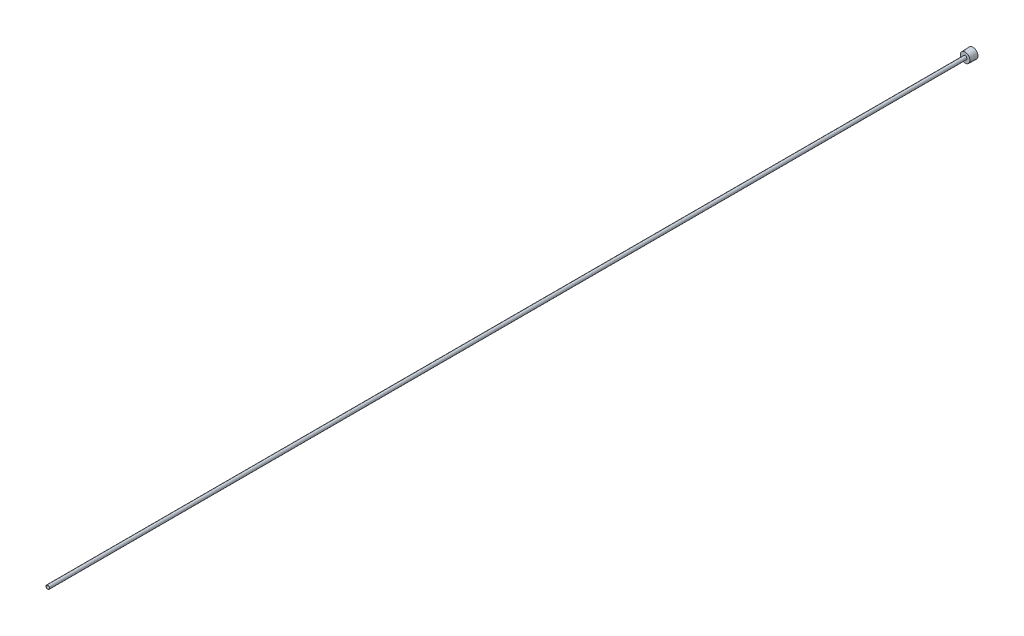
ISO-10303-21;
HEADER;
FILE_DESCRIPTION(('STEP AP214'),'2;1');
FILE_NAME('part.step','',(''),(''),'','','');
FILE_SCHEMA(('AUTOMOTIVE_DESIGN { 1 0 10303 214 1 1 1 1 }'));
ENDSEC;
DATA;
#1=APPLICATION_CONTEXT('core data for automotive mechanical design processes');
#2=APPLICATION_PROTOCOL_DEFINITION('international standard','automotive_design',2000,#1);
#3=PRODUCT_CONTEXT('',#1,'mechanical');
#4=PRODUCT('Part','Part','',(#3));
#5=PRODUCT_RELATED_PRODUCT_CATEGORY('part','',(#4));
#6=PRODUCT_DEFINITION_FORMATION('','',#4);
#7=PRODUCT_DEFINITION_CONTEXT('part definition',#1,'design');
#8=PRODUCT_DEFINITION('design','',#6,#7);
#9=PRODUCT_DEFINITION_SHAPE('','',#8);
#10=(LENGTH_UNIT() NAMED_UNIT(*) SI_UNIT(.MILLI.,.METRE.));
#11=(NAMED_UNIT(*) PLANE_ANGLE_UNIT() SI_UNIT($,.RADIAN.));
#12=(NAMED_UNIT(*) SI_UNIT($,.STERADIAN.) SOLID_ANGLE_UNIT());
#13=UNCERTAINTY_MEASURE_WITH_UNIT(LENGTH_MEASURE(1.E-05),#10,'distance_accuracy_value','');
#14=(GEOMETRIC_REPRESENTATION_CONTEXT(3) GLOBAL_UNCERTAINTY_ASSIGNED_CONTEXT((#13)) GLOBAL_UNIT_ASSIGNED_CONTEXT((#10,
#11,#12)) REPRESENTATION_CONTEXT('',''));
#15=CARTESIAN_POINT('',(0.,0.,0.));
#16=DIRECTION('',(0.,0.,1.));
#17=DIRECTION('',(1.,0.,0.));
#18=AXIS2_PLACEMENT_3D('',#15,#16,#17);
#19=CARTESIAN_POINT('',(0.,0.,0.));
#20=DIRECTION('',(0.,0.,1.));
#21=DIRECTION('',(1.,0.,0.));
#22=AXIS2_PLACEMENT_3D('',#19,#20,#21);
#23=CYLINDRICAL_SURFACE('',#22,2.1209);
#24=CARTESIAN_POINT('',(0.,0.,1219.2));
#25=DIRECTION('',(0.,0.,1.));
#26=DIRECTION('',(1.,0.,0.));
#27=AXIS2_PLACEMENT_3D('',#24,#25,#26);
#28=CIRCLE('',#27,2.1209);
#29=CARTESIAN_POINT('',(2.1209,0.,1219.2));
#30=VERTEX_POINT('',#29);
#31=EDGE_CURVE('E142',#30,#30,#28,.T.);
#32=CARTESIAN_POINT('',(0.,0.,6.35));
#33=DIRECTION('',(0.,0.,-1.));
#34=DIRECTION('',(-1.,0.,0.));
#35=AXIS2_PLACEMENT_3D('',#32,#33,#34);
#36=CIRCLE('',#35,2.1209);
#37=CARTESIAN_POINT('',(2.1209,0.,6.35));
#38=VERTEX_POINT('',#37);
#39=EDGE_CURVE('E37',#38,#38,#36,.F.);
#40=CARTESIAN_POINT('',(2.1209,0.,1219.2));
#41=CARTESIAN_POINT('',(2.1209,0.,1206.56614583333));
#42=CARTESIAN_POINT('',(2.1209,0.,1193.93229166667));
#43=CARTESIAN_POINT('',(2.1209,0.,1168.66458333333));
#44=CARTESIAN_POINT('',(2.1209,0.,1156.03072916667));
#45=CARTESIAN_POINT('',(2.1209,0.,1130.76302083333));
#46=CARTESIAN_POINT('',(2.1209,0.,1118.12916666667));
#47=CARTESIAN_POINT('',(2.1209,0.,1092.86145833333));
#48=CARTESIAN_POINT('',(2.1209,0.,1080.22760416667));
#49=CARTESIAN_POINT('',(2.1209,0.,1054.95989583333));
#50=CARTESIAN_POINT('',(2.1209,0.,1042.32604166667));
#51=CARTESIAN_POINT('',(2.1209,0.,1017.05833333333));
#52=CARTESIAN_POINT('',(2.1209,0.,1004.42447916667));
#53=CARTESIAN_POINT('',(2.1209,0.,979.156770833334));
#54=CARTESIAN_POINT('',(2.1209,0.,966.522916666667));
#55=CARTESIAN_POINT('',(2.1209,0.,941.255208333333));
#56=CARTESIAN_POINT('',(2.1209,0.,928.621354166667));
#57=CARTESIAN_POINT('',(2.1209,0.,903.353645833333));
#58=CARTESIAN_POINT('',(2.1209,0.,890.719791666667));
#59=CARTESIAN_POINT('',(2.1209,0.,865.452083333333));
#60=CARTESIAN_POINT('',(2.1209,0.,852.818229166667));
#61=CARTESIAN_POINT('',(2.1209,0.,827.550520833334));
#62=CARTESIAN_POINT('',(2.1209,0.,814.916666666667));
#63=CARTESIAN_POINT('',(2.1209,0.,789.648958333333));
#64=CARTESIAN_POINT('',(2.1209,0.,777.015104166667));
#65=CARTESIAN_POINT('',(2.1209,0.,751.747395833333));
#66=CARTESIAN_POINT('',(2.1209,0.,739.113541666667));
#67=CARTESIAN_POINT('',(2.1209,0.,713.845833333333));
#68=CARTESIAN_POINT('',(2.1209,0.,701.211979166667));
#69=CARTESIAN_POINT('',(2.1209,0.,675.944270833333));
#70=CARTESIAN_POINT('',(2.1209,0.,663.310416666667));
#71=CARTESIAN_POINT('',(2.1209,0.,638.042708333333));
#72=CARTESIAN_POINT('',(2.1209,0.,625.408854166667));
#73=CARTESIAN_POINT('',(2.1209,0.,600.141145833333));
#74=CARTESIAN_POINT('',(2.1209,0.,587.507291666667));
#75=CARTESIAN_POINT('',(2.1209,0.,562.239583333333));
#76=CARTESIAN_POINT('',(2.1209,0.,549.605729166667));
#77=CARTESIAN_POINT('',(2.1209,0.,524.338020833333));
#78=CARTESIAN_POINT('',(2.1209,0.,511.704166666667));
#79=CARTESIAN_POINT('',(2.1209,0.,486.436458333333));
#80=CARTESIAN_POINT('',(2.1209,0.,473.802604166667));
#81=CARTESIAN_POINT('',(2.1209,0.,448.534895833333));
#82=CARTESIAN_POINT('',(2.1209,0.,435.901041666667));
#83=CARTESIAN_POINT('',(2.1209,0.,410.633333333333));
#84=CARTESIAN_POINT('',(2.1209,0.,397.999479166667));
#85=CARTESIAN_POINT('',(2.1209,0.,372.731770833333));
#86=CARTESIAN_POINT('',(2.1209,0.,360.097916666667));
#87=CARTESIAN_POINT('',(2.1209,0.,334.830208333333));
#88=CARTESIAN_POINT('',(2.1209,0.,322.196354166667));
#89=CARTESIAN_POINT('',(2.1209,0.,296.928645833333));
#90=CARTESIAN_POINT('',(2.1209,0.,284.294791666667));
#91=CARTESIAN_POINT('',(2.1209,0.,259.027083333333));
#92=CARTESIAN_POINT('',(2.1209,0.,246.393229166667));
#93=CARTESIAN_POINT('',(2.1209,0.,221.125520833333));
#94=CARTESIAN_POINT('',(2.1209,0.,208.491666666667));
#95=CARTESIAN_POINT('',(2.1209,0.,183.223958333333));
#96=CARTESIAN_POINT('',(2.1209,0.,170.590104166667));
#97=CARTESIAN_POINT('',(2.1209,0.,145.322395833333));
#98=CARTESIAN_POINT('',(2.1209,0.,132.688541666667));
#99=CARTESIAN_POINT('',(2.1209,0.,107.420833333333));
#100=CARTESIAN_POINT('',(2.1209,0.,94.7869791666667));
#101=CARTESIAN_POINT('',(2.1209,0.,69.5192708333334));
#102=CARTESIAN_POINT('',(2.1209,0.,56.8854166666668));
#103=CARTESIAN_POINT('',(2.1209,0.,31.6177083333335));
#104=CARTESIAN_POINT('',(2.1209,0.,18.9838541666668));
#105=CARTESIAN_POINT('',(2.1209,0.,6.35000000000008));
#106=B_SPLINE_CURVE_WITH_KNOTS('',3,(#40,#41,#42,#43,#44,#45,#46,#47,#48,#49,#50,#51,#52,#53,
#54,#55,#56,#57,#58,#59,#60,#61,#62,#63,#64,#65,#66,#67,#68,#69,#70,#71,#72,#73,#74,#75,#76,#77,
#78,#79,#80,#81,#82,#83,#84,#85,#86,#87,#88,#89,#90,#91,#92,#93,#94,#95,#96,#97,#98,#99,#100,
#101,#102,#103,#104,#105),.UNSPECIFIED.,.F.,.F.,(4,2,2,2,2,2,2,2,2,2,2,2,2,2,2,2,2,2,2,2,2,2,2,
2,2,2,2,2,2,2,2,2,4),(0.,37.9015625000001,75.803125,113.7046875,151.60625,189.5078125,
227.409375,265.3109375,303.2125,341.1140625,379.015625,416.9171875,454.81875,492.7203125,
530.621875,568.5234375,606.425,644.3265625,682.228125,720.1296875,758.03125,795.9328125,
833.834375,871.7359375,909.6375,947.5390625,985.440625,1023.3421875,1061.24375,1099.1453125,
1137.046875,1174.9484375,1212.85),.UNSPECIFIED.);
#107=EDGE_CURVE('BSEAM33',#30,#38,#106,.T.);
#108=ORIENTED_EDGE('',*,*,#31,.T.);
#109=ORIENTED_EDGE('',*,*,#39,.F.);
#110=ORIENTED_EDGE('',*,*,#107,.T.);
#111=ORIENTED_EDGE('',*,*,#107,.F.);
#112=EDGE_LOOP('',(#108,#110,#109,#111));
#113=FACE_BOUND('',#112,.T.);
#114=ADVANCED_FACE('F33',(#113),#23,.F.);
#115=CARTESIAN_POINT('',(0.,0.,0.));
#116=DIRECTION('',(0.,0.,-1.));
#117=DIRECTION('',(-1.,0.,0.));
#118=AXIS2_PLACEMENT_3D('',#115,#116,#117);
#119=CONICAL_SURFACE('',#118,6.7183,0.0364599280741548);
#120=CARTESIAN_POINT('',(0.,0.,10.3124));
#121=DIRECTION('',(0.,0.,1.));
#122=DIRECTION('',(1.,0.,0.));
#123=AXIS2_PLACEMENT_3D('',#120,#121,#122);
#124=CIRCLE('',#123,6.34214394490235);
#125=CARTESIAN_POINT('',(6.34214394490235,0.,10.3124));
#126=VERTEX_POINT('',#125);
#127=EDGE_CURVE('E11',#126,#126,#124,.T.);
#128=ORIENTED_EDGE('',*,*,#127,.F.);
#129=EDGE_LOOP('',(#128));
#130=FACE_BOUND('',#129,.T.);
#131=CARTESIAN_POINT('',(0.,0.,0.));
#132=DIRECTION('',(0.,0.,1.));
#133=DIRECTION('',(1.,0.,0.));
#134=AXIS2_PLACEMENT_3D('',#131,#132,#133);
#135=CIRCLE('',#134,6.7183);
#136=CARTESIAN_POINT('',(6.7183,0.,0.));
#137=VERTEX_POINT('',#136);
#138=EDGE_CURVE('E145',#137,#137,#135,.T.);
#139=ORIENTED_EDGE('',*,*,#138,.T.);
#140=EDGE_LOOP('',(#139));
#141=FACE_BOUND('',#140,.T.);
#142=ADVANCED_FACE('F35',(#130,#141),#119,.T.);
#143=CARTESIAN_POINT('',(0.,6.34214394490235,10.3124));
#144=DIRECTION('',(0.,0.,-1.));
#145=DIRECTION('',(-1.,0.,0.));
#146=AXIS2_PLACEMENT_3D('',#143,#144,#145);
#147=PLANE('',#146);
#148=CARTESIAN_POINT('',(0.,0.,10.3124));
#149=DIRECTION('',(0.,0.,1.));
#150=DIRECTION('',(1.,0.,0.));
#151=AXIS2_PLACEMENT_3D('',#148,#149,#150);
#152=CIRCLE('',#151,2.3749);
#153=CARTESIAN_POINT('',(2.3749,0.,10.3124));
#154=VERTEX_POINT('',#153);
#155=EDGE_CURVE('E42',#154,#154,#152,.T.);
#156=ORIENTED_EDGE('',*,*,#155,.F.);
#157=EDGE_LOOP('',(#156));
#158=FACE_BOUND('',#157,.T.);
#159=ORIENTED_EDGE('',*,*,#127,.T.);
#160=EDGE_LOOP('',(#159));
#161=FACE_BOUND('',#160,.T.);
#162=ADVANCED_FACE('F156',(#158,#161),#147,.F.);
#163=CARTESIAN_POINT('',(0.,0.,331.124179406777));
#164=DIRECTION('',(0.,0.,1.));
#165=DIRECTION('',(1.,0.,0.));
#166=AXIS2_PLACEMENT_3D('',#163,#164,#165);
#167=CYLINDRICAL_SURFACE('',#166,2.37489999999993);
#168=CARTESIAN_POINT('',(0.,0.,1219.2));
#169=DIRECTION('',(0.,0.,1.));
#170=DIRECTION('',(1.,0.,0.));
#171=AXIS2_PLACEMENT_3D('',#168,#169,#170);
#172=CIRCLE('',#171,2.37489999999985);
#173=CARTESIAN_POINT('',(2.37489999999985,0.,1219.2));
#174=VERTEX_POINT('',#173);
#175=EDGE_CURVE('E148',#174,#174,#172,.T.);
#176=ORIENTED_EDGE('',*,*,#175,.F.);
#177=EDGE_LOOP('',(#176));
#178=FACE_BOUND('',#177,.T.);
#179=ORIENTED_EDGE('',*,*,#155,.T.);
#180=EDGE_LOOP('',(#179));
#181=FACE_BOUND('',#180,.T.);
#182=ADVANCED_FACE('F154',(#178,#181),#167,.T.);
#183=CARTESIAN_POINT('',(0.,2.37489999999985,1219.2));
#184=DIRECTION('',(0.,0.,-1.));
#185=DIRECTION('',(-1.,0.,0.));
#186=AXIS2_PLACEMENT_3D('',#183,#184,#185);
#187=PLANE('',#186);
#188=ORIENTED_EDGE('',*,*,#31,.F.);
#189=EDGE_LOOP('',(#188));
#190=FACE_BOUND('',#189,.T.);
#191=ORIENTED_EDGE('',*,*,#175,.T.);
#192=EDGE_LOOP('',(#191));
#193=FACE_BOUND('',#192,.T.);
#194=ADVANCED_FACE('F167',(#190,#193),#187,.F.);
#195=CARTESIAN_POINT('',(0.,0.,0.));
#196=DIRECTION('',(0.,0.,1.));
#197=DIRECTION('',(1.,0.,0.));
#198=AXIS2_PLACEMENT_3D('',#195,#196,#197);
#199=PLANE('',#198);
#200=DIRECTION('',(-0.866025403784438,-0.5,0.));
#201=VECTOR('',#200,1.);
#202=CARTESIAN_POINT('',(3.175,-1.83308710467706,0.));
#203=LINE('',#202,#201);
#204=CARTESIAN_POINT('',(3.175,-1.83308710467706,0.));
#205=VERTEX_POINT('',#204);
#206=CARTESIAN_POINT('',(0.,-3.66617420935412,0.));
#207=VERTEX_POINT('',#206);
#208=EDGE_CURVE('E124',#205,#207,#203,.T.);
#209=ORIENTED_EDGE('',*,*,#208,.F.);
#210=DIRECTION('',(0.,-1.,0.));
#211=VECTOR('',#210,1.);
#212=CARTESIAN_POINT('',(3.175,1.83308710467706,0.));
#213=LINE('',#212,#211);
#214=CARTESIAN_POINT('',(3.175,1.83308710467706,0.));
#215=VERTEX_POINT('',#214);
#216=EDGE_CURVE('E49',#215,#205,#213,.T.);
#217=ORIENTED_EDGE('',*,*,#216,.F.);
#218=DIRECTION('',(0.866025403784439,-0.5,0.));
#219=VECTOR('',#218,1.);
#220=CARTESIAN_POINT('',(0.,3.66617420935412,0.));
#221=LINE('',#220,#219);
#222=CARTESIAN_POINT('',(0.,3.66617420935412,0.));
#223=VERTEX_POINT('',#222);
#224=EDGE_CURVE('E133',#223,#215,#221,.T.);
#225=ORIENTED_EDGE('',*,*,#224,.F.);
#226=DIRECTION('',(0.866025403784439,0.5,0.));
#227=VECTOR('',#226,1.);
#228=CARTESIAN_POINT('',(-3.175,1.83308710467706,0.));
#229=LINE('',#228,#227);
#230=CARTESIAN_POINT('',(-3.175,1.83308710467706,0.));
#231=VERTEX_POINT('',#230);
#232=EDGE_CURVE('E131',#231,#223,#229,.T.);
#233=ORIENTED_EDGE('',*,*,#232,.F.);
#234=DIRECTION('',(0.,1.,0.));
#235=VECTOR('',#234,1.);
#236=CARTESIAN_POINT('',(-3.175,-1.83308710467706,0.));
#237=LINE('',#236,#235);
#238=CARTESIAN_POINT('',(-3.175,-1.83308710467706,0.));
#239=VERTEX_POINT('',#238);
#240=EDGE_CURVE('E97',#239,#231,#237,.T.);
#241=ORIENTED_EDGE('',*,*,#240,.F.);
#242=DIRECTION('',(-0.866025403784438,0.5,0.));
#243=VECTOR('',#242,1.);
#244=CARTESIAN_POINT('',(0.,-3.66617420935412,0.));
#245=LINE('',#244,#243);
#246=EDGE_CURVE('E127',#207,#239,#245,.T.);
#247=ORIENTED_EDGE('',*,*,#246,.F.);
#248=EDGE_LOOP('',(#209,#217,#225,#233,#241,#247));
#249=FACE_BOUND('',#248,.T.);
#250=ORIENTED_EDGE('',*,*,#138,.F.);
#251=EDGE_LOOP('',(#250));
#252=FACE_BOUND('',#251,.T.);
#253=ADVANCED_FACE('F165',(#249,#252),#199,.F.);
#254=CARTESIAN_POINT('',(3.175,-1.83308710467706,6.35));
#255=DIRECTION('',(0.,0.,-1.));
#256=DIRECTION('',(-1.,0.,0.));
#257=AXIS2_PLACEMENT_3D('',#254,#255,#256);
#258=PLANE('',#257);
#259=DIRECTION('',(0.,-1.,0.));
#260=VECTOR('',#259,1.);
#261=CARTESIAN_POINT('',(3.175,1.83308710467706,6.35));
#262=LINE('',#261,#260);
#263=CARTESIAN_POINT('',(3.175,1.83308710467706,6.35));
#264=VERTEX_POINT('',#263);
#265=CARTESIAN_POINT('',(3.175,-1.83308710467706,6.35));
#266=VERTEX_POINT('',#265);
#267=EDGE_CURVE('E135',#264,#266,#262,.T.);
#268=ORIENTED_EDGE('',*,*,#267,.T.);
#269=DIRECTION('',(-0.866025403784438,-0.5,0.));
#270=VECTOR('',#269,1.);
#271=CARTESIAN_POINT('',(3.175,-1.83308710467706,6.35));
#272=LINE('',#271,#270);
#273=CARTESIAN_POINT('',(0.,-3.66617420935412,6.35));
#274=VERTEX_POINT('',#273);
#275=EDGE_CURVE('E118',#266,#274,#272,.T.);
#276=ORIENTED_EDGE('',*,*,#275,.T.);
#277=DIRECTION('',(-0.866025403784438,0.5,0.));
#278=VECTOR('',#277,1.);
#279=CARTESIAN_POINT('',(0.,-3.66617420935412,6.35));
#280=LINE('',#279,#278);
#281=CARTESIAN_POINT('',(-3.175,-1.83308710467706,6.35));
#282=VERTEX_POINT('',#281);
#283=EDGE_CURVE('E116',#274,#282,#280,.T.);
#284=ORIENTED_EDGE('',*,*,#283,.T.);
#285=DIRECTION('',(0.,1.,0.));
#286=VECTOR('',#285,1.);
#287=CARTESIAN_POINT('',(-3.175,-1.83308710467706,6.35));
#288=LINE('',#287,#286);
#289=CARTESIAN_POINT('',(-3.175,1.83308710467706,6.35));
#290=VERTEX_POINT('',#289);
#291=EDGE_CURVE('E94',#282,#290,#288,.T.);
#292=ORIENTED_EDGE('',*,*,#291,.T.);
#293=DIRECTION('',(0.866025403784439,0.5,0.));
#294=VECTOR('',#293,1.);
#295=CARTESIAN_POINT('',(-3.175,1.83308710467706,6.35));
#296=LINE('',#295,#294);
#297=CARTESIAN_POINT('',(0.,3.66617420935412,6.35));
#298=VERTEX_POINT('',#297);
#299=EDGE_CURVE('E105',#290,#298,#296,.T.);
#300=ORIENTED_EDGE('',*,*,#299,.T.);
#301=DIRECTION('',(0.866025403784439,-0.5,0.));
#302=VECTOR('',#301,1.);
#303=CARTESIAN_POINT('',(0.,3.66617420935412,6.35));
#304=LINE('',#303,#302);
#305=EDGE_CURVE('E109',#298,#264,#304,.T.);
#306=ORIENTED_EDGE('',*,*,#305,.T.);
#307=EDGE_LOOP('',(#268,#276,#284,#292,#300,#306));
#308=FACE_BOUND('',#307,.T.);
#309=ORIENTED_EDGE('',*,*,#39,.T.);
#310=EDGE_LOOP('',(#309));
#311=FACE_BOUND('',#310,.T.);
#312=ADVANCED_FACE('F112',(#308,#311),#258,.T.);
#313=CARTESIAN_POINT('',(3.175,1.83308710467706,6.35));
#314=DIRECTION('',(1.,0.,0.));
#315=DIRECTION('',(0.,0.,-1.));
#316=AXIS2_PLACEMENT_3D('',#313,#314,#315);
#317=PLANE('',#316);
#318=ORIENTED_EDGE('',*,*,#216,.T.);
#319=DIRECTION('',(0.,0.,-1.));
#320=VECTOR('',#319,1.);
#321=CARTESIAN_POINT('',(3.175,-1.83308710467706,6.35));
#322=LINE('',#321,#320);
#323=EDGE_CURVE('E79',#266,#205,#322,.T.);
#324=ORIENTED_EDGE('',*,*,#323,.F.);
#325=ORIENTED_EDGE('',*,*,#267,.F.);
#326=DIRECTION('',(0.,0.,-1.));
#327=VECTOR('',#326,1.);
#328=CARTESIAN_POINT('',(3.175,1.83308710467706,6.35));
#329=LINE('',#328,#327);
#330=EDGE_CURVE('E57',#264,#215,#329,.T.);
#331=ORIENTED_EDGE('',*,*,#330,.T.);
#332=EDGE_LOOP('',(#318,#324,#325,#331));
#333=FACE_BOUND('',#332,.T.);
#334=ADVANCED_FACE('F174',(#333),#317,.F.);
#335=CARTESIAN_POINT('',(0.,3.66617420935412,6.35));
#336=DIRECTION('',(0.5,0.866025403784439,0.));
#337=DIRECTION('',(-0.866025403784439,0.5,0.));
#338=AXIS2_PLACEMENT_3D('',#335,#336,#337);
#339=PLANE('',#338);
#340=ORIENTED_EDGE('',*,*,#224,.T.);
#341=ORIENTED_EDGE('',*,*,#330,.F.);
#342=ORIENTED_EDGE('',*,*,#305,.F.);
#343=DIRECTION('',(0.,0.,-1.));
#344=VECTOR('',#343,1.);
#345=CARTESIAN_POINT('',(0.,3.66617420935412,6.35));
#346=LINE('',#345,#344);
#347=EDGE_CURVE('E101',#298,#223,#346,.T.);
#348=ORIENTED_EDGE('',*,*,#347,.T.);
#349=EDGE_LOOP('',(#340,#341,#342,#348));
#350=FACE_BOUND('',#349,.T.);
#351=ADVANCED_FACE('F188',(#350),#339,.F.);
#352=CARTESIAN_POINT('',(-3.175,1.83308710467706,6.35));
#353=DIRECTION('',(-0.5,0.866025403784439,0.));
#354=DIRECTION('',(-0.866025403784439,-0.5,0.));
#355=AXIS2_PLACEMENT_3D('',#352,#353,#354);
#356=PLANE('',#355);
#357=ORIENTED_EDGE('',*,*,#232,.T.);
#358=ORIENTED_EDGE('',*,*,#347,.F.);
#359=ORIENTED_EDGE('',*,*,#299,.F.);
#360=DIRECTION('',(0.,0.,-1.));
#361=VECTOR('',#360,1.);
#362=CARTESIAN_POINT('',(-3.175,1.83308710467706,6.35));
#363=LINE('',#362,#361);
#364=EDGE_CURVE('E90',#290,#231,#363,.T.);
#365=ORIENTED_EDGE('',*,*,#364,.T.);
#366=EDGE_LOOP('',(#357,#358,#359,#365));
#367=FACE_BOUND('',#366,.T.);
#368=ADVANCED_FACE('F106',(#367),#356,.F.);
#369=CARTESIAN_POINT('',(-3.175,-1.83308710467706,6.35));
#370=DIRECTION('',(-1.,0.,0.));
#371=DIRECTION('',(0.,-1.,0.));
#372=AXIS2_PLACEMENT_3D('',#369,#370,#371);
#373=PLANE('',#372);
#374=ORIENTED_EDGE('',*,*,#240,.T.);
#375=ORIENTED_EDGE('',*,*,#364,.F.);
#376=ORIENTED_EDGE('',*,*,#291,.F.);
#377=DIRECTION('',(0.,0.,-1.));
#378=VECTOR('',#377,1.);
#379=CARTESIAN_POINT('',(-3.175,-1.83308710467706,6.35));
#380=LINE('',#379,#378);
#381=EDGE_CURVE('E102',#282,#239,#380,.T.);
#382=ORIENTED_EDGE('',*,*,#381,.T.);
#383=EDGE_LOOP('',(#374,#375,#376,#382));
#384=FACE_BOUND('',#383,.T.);
#385=ADVANCED_FACE('F92',(#384),#373,.F.);
#386=CARTESIAN_POINT('',(0.,-3.66617420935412,6.35));
#387=DIRECTION('',(-0.5,-0.866025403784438,0.));
#388=DIRECTION('',(0.866025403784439,-0.5,0.));
#389=AXIS2_PLACEMENT_3D('',#386,#387,#388);
#390=PLANE('',#389);
#391=ORIENTED_EDGE('',*,*,#246,.T.);
#392=ORIENTED_EDGE('',*,*,#381,.F.);
#393=ORIENTED_EDGE('',*,*,#283,.F.);
#394=DIRECTION('',(0.,0.,-1.));
#395=VECTOR('',#394,1.);
#396=CARTESIAN_POINT('',(0.,-3.66617420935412,6.35));
#397=LINE('',#396,#395);
#398=EDGE_CURVE('E139',#274,#207,#397,.T.);
#399=ORIENTED_EDGE('',*,*,#398,.T.);
#400=EDGE_LOOP('',(#391,#392,#393,#399));
#401=FACE_BOUND('',#400,.T.);
#402=ADVANCED_FACE('F192',(#401),#390,.F.);
#403=CARTESIAN_POINT('',(3.175,-1.83308710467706,6.35));
#404=DIRECTION('',(0.5,-0.866025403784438,0.));
#405=DIRECTION('',(0.866025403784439,0.5,0.));
#406=AXIS2_PLACEMENT_3D('',#403,#404,#405);
#407=PLANE('',#406);
#408=ORIENTED_EDGE('',*,*,#208,.T.);
#409=ORIENTED_EDGE('',*,*,#398,.F.);
#410=ORIENTED_EDGE('',*,*,#275,.F.);
#411=ORIENTED_EDGE('',*,*,#323,.T.);
#412=EDGE_LOOP('',(#408,#409,#410,#411));
#413=FACE_BOUND('',#412,.T.);
#414=ADVANCED_FACE('F189',(#413),#407,.F.);
#415=CLOSED_SHELL('',(#114,#142,#162,#182,#194,#253,#312,#334,#351,#368,#385,#402,#414));
#416=MANIFOLD_SOLID_BREP('B2',#415);
#417=ADVANCED_BREP_SHAPE_REPRESENTATION('',(#18,#416),#14);
#418=SHAPE_DEFINITION_REPRESENTATION(#9,#417);
ENDSEC;
END-ISO-10303-21;
